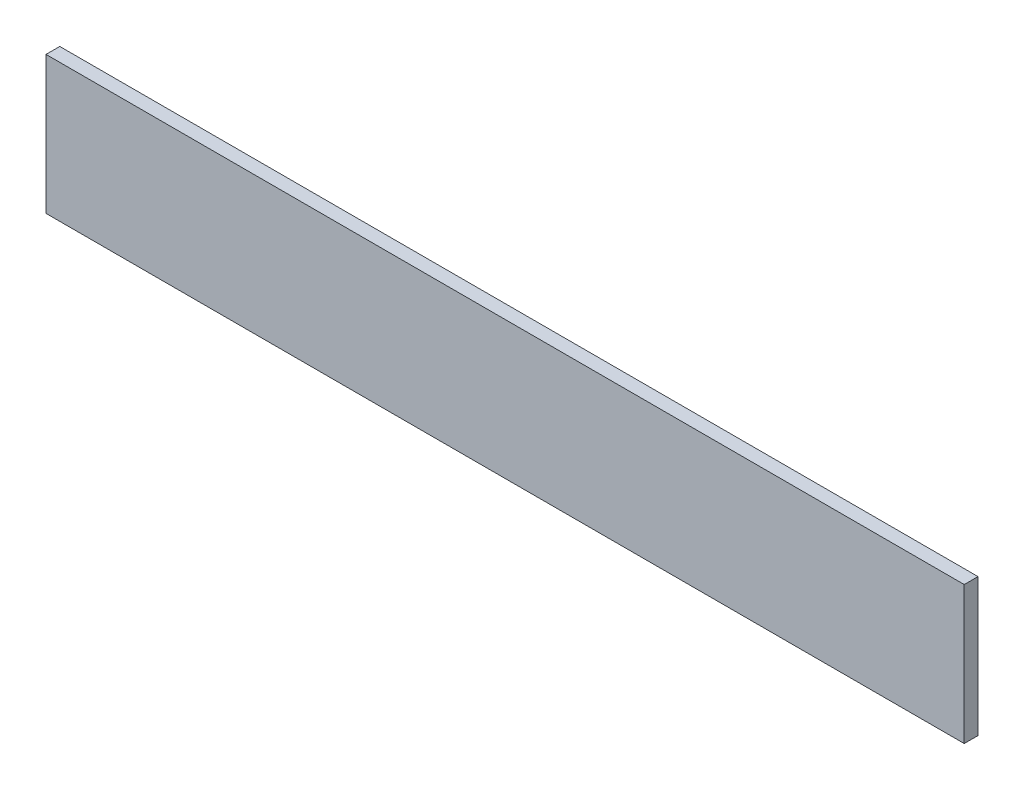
from build123d import *

# Parameters (mm, degrees)
ESQUISSE1_W      = 80
ESQUISSE1_H      = 12
EXTRUSION1_DEPTH = 0.6


with BuildPart() as part:
    # Esquisse1 → Extrusion1 (new, symmetric)
    with BuildSketch(Plane.XY):
        with Locations((40, 6)):
            Rectangle(ESQUISSE1_W, ESQUISSE1_H)
    extrude(amount=EXTRUSION1_DEPTH, both=True)


solid = part.part
